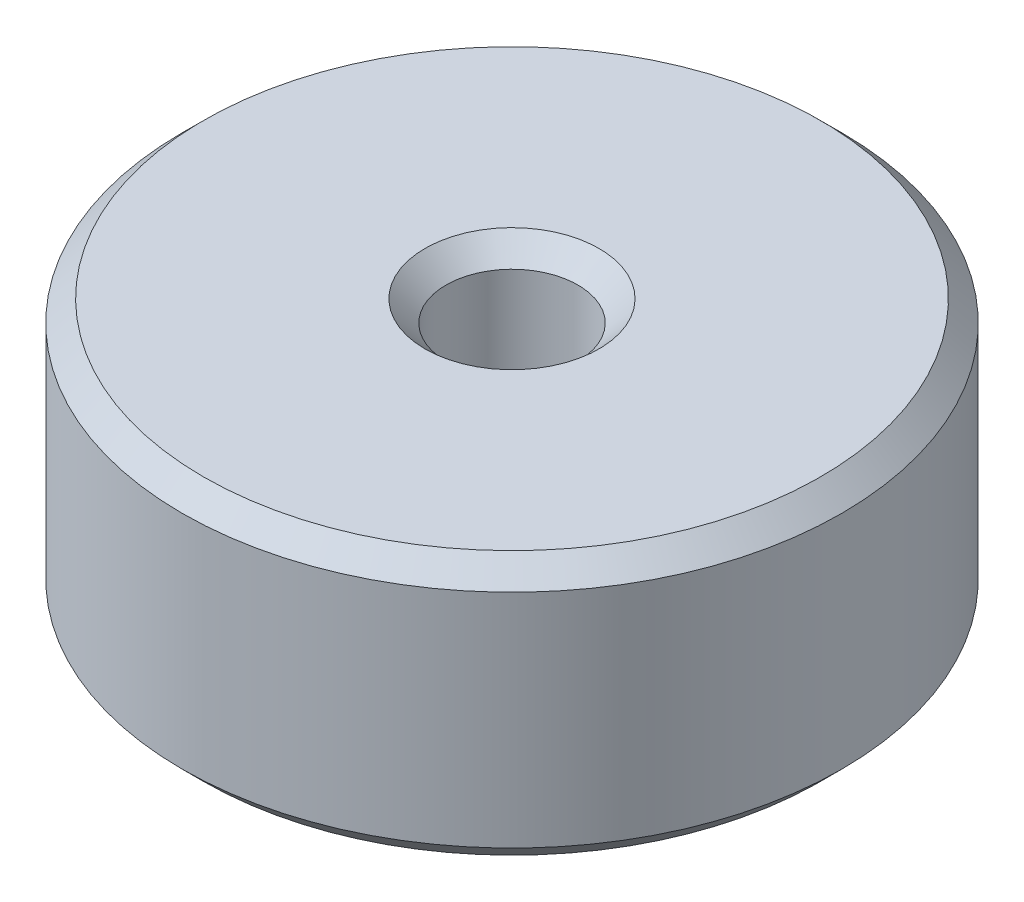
ISO-10303-21;
HEADER;
FILE_DESCRIPTION(('STEP AP214'),'2;1');
FILE_NAME('part.step','',(''),(''),'','','');
FILE_SCHEMA(('AUTOMOTIVE_DESIGN { 1 0 10303 214 1 1 1 1 }'));
ENDSEC;
DATA;
#1=APPLICATION_CONTEXT('core data for automotive mechanical design processes');
#2=APPLICATION_PROTOCOL_DEFINITION('international standard','automotive_design',2000,#1);
#3=PRODUCT_CONTEXT('',#1,'mechanical');
#4=PRODUCT('Part','Part','',(#3));
#5=PRODUCT_RELATED_PRODUCT_CATEGORY('part','',(#4));
#6=PRODUCT_DEFINITION_FORMATION('','',#4);
#7=PRODUCT_DEFINITION_CONTEXT('part definition',#1,'design');
#8=PRODUCT_DEFINITION('design','',#6,#7);
#9=PRODUCT_DEFINITION_SHAPE('','',#8);
#10=(LENGTH_UNIT() NAMED_UNIT(*) SI_UNIT(.MILLI.,.METRE.));
#11=(NAMED_UNIT(*) PLANE_ANGLE_UNIT() SI_UNIT($,.RADIAN.));
#12=(NAMED_UNIT(*) SI_UNIT($,.STERADIAN.) SOLID_ANGLE_UNIT());
#13=UNCERTAINTY_MEASURE_WITH_UNIT(LENGTH_MEASURE(1.E-05),#10,'distance_accuracy_value','');
#14=(GEOMETRIC_REPRESENTATION_CONTEXT(3) GLOBAL_UNCERTAINTY_ASSIGNED_CONTEXT((#13)) GLOBAL_UNIT_ASSIGNED_CONTEXT((#10,
#11,#12)) REPRESENTATION_CONTEXT('',''));
#15=CARTESIAN_POINT('',(0.,0.,0.));
#16=DIRECTION('',(0.,0.,1.));
#17=DIRECTION('',(1.,0.,0.));
#18=AXIS2_PLACEMENT_3D('',#15,#16,#17);
#19=CARTESIAN_POINT('',(0.,3.175,0.));
#20=DIRECTION('',(0.,1.,0.));
#21=DIRECTION('',(0.,0.,1.));
#22=AXIS2_PLACEMENT_3D('',#19,#20,#21);
#23=PLANE('',#22);
#24=CARTESIAN_POINT('',(0.,3.175,0.));
#25=DIRECTION('',(0.,1.,0.));
#26=DIRECTION('',(0.,0.,1.));
#27=AXIS2_PLACEMENT_3D('',#24,#25,#26);
#28=CIRCLE('',#27,1.04775);
#29=CARTESIAN_POINT('',(0.,3.175,1.04775));
#30=VERTEX_POINT('',#29);
#31=EDGE_CURVE('E10',#30,#30,#28,.F.);
#32=ORIENTED_EDGE('',*,*,#31,.T.);
#33=EDGE_LOOP('',(#32));
#34=FACE_BOUND('',#33,.T.);
#35=CARTESIAN_POINT('',(0.,3.175,0.));
#36=DIRECTION('',(0.,1.,0.));
#37=DIRECTION('',(0.,0.,1.));
#38=AXIS2_PLACEMENT_3D('',#35,#36,#37);
#39=CIRCLE('',#38,3.71475);
#40=CARTESIAN_POINT('',(0.,3.175,3.71475));
#41=VERTEX_POINT('',#40);
#42=EDGE_CURVE('E51',#41,#41,#39,.T.);
#43=ORIENTED_EDGE('',*,*,#42,.T.);
#44=EDGE_LOOP('',(#43));
#45=FACE_BOUND('',#44,.T.);
#46=ADVANCED_FACE('F42',(#34,#45),#23,.T.);
#47=CARTESIAN_POINT('',(0.,0.,0.));
#48=DIRECTION('',(0.,1.,0.));
#49=DIRECTION('',(0.,0.,1.));
#50=AXIS2_PLACEMENT_3D('',#47,#48,#49);
#51=PLANE('',#50);
#52=CARTESIAN_POINT('',(0.,0.,0.));
#53=DIRECTION('',(0.,1.,0.));
#54=DIRECTION('',(0.,0.,1.));
#55=AXIS2_PLACEMENT_3D('',#52,#53,#54);
#56=CIRCLE('',#55,1.04775);
#57=CARTESIAN_POINT('',(0.,0.,1.04775));
#58=VERTEX_POINT('',#57);
#59=EDGE_CURVE('E77',#58,#58,#56,.T.);
#60=ORIENTED_EDGE('',*,*,#59,.T.);
#61=EDGE_LOOP('',(#60));
#62=FACE_BOUND('',#61,.T.);
#63=CARTESIAN_POINT('',(0.,0.,0.));
#64=DIRECTION('',(0.,1.,0.));
#65=DIRECTION('',(0.,0.,1.));
#66=AXIS2_PLACEMENT_3D('',#63,#64,#65);
#67=CIRCLE('',#66,3.71475);
#68=CARTESIAN_POINT('',(0.,0.,3.71475));
#69=VERTEX_POINT('',#68);
#70=EDGE_CURVE('E81',#69,#69,#67,.F.);
#71=ORIENTED_EDGE('',*,*,#70,.T.);
#72=EDGE_LOOP('',(#71));
#73=FACE_BOUND('',#72,.T.);
#74=ADVANCED_FACE('F87',(#62,#73),#51,.F.);
#75=CARTESIAN_POINT('',(0.,3.175,0.));
#76=DIRECTION('',(0.,-1.,0.));
#77=DIRECTION('',(0.,0.,-1.));
#78=AXIS2_PLACEMENT_3D('',#75,#76,#77);
#79=CYLINDRICAL_SURFACE('',#78,3.96875);
#80=CARTESIAN_POINT('',(0.,0.254000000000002,0.));
#81=DIRECTION('',(0.,1.,0.));
#82=DIRECTION('',(0.,0.,1.));
#83=AXIS2_PLACEMENT_3D('',#80,#81,#82);
#84=CIRCLE('',#83,3.96875);
#85=CARTESIAN_POINT('',(0.,0.254000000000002,3.96875));
#86=VERTEX_POINT('',#85);
#87=EDGE_CURVE('E57',#86,#86,#84,.T.);
#88=ORIENTED_EDGE('',*,*,#87,.T.);
#89=EDGE_LOOP('',(#88));
#90=FACE_BOUND('',#89,.T.);
#91=CARTESIAN_POINT('',(0.,2.921,0.));
#92=DIRECTION('',(0.,1.,0.));
#93=DIRECTION('',(0.,0.,1.));
#94=AXIS2_PLACEMENT_3D('',#91,#92,#93);
#95=CIRCLE('',#94,3.96875);
#96=CARTESIAN_POINT('',(0.,2.921,3.96875));
#97=VERTEX_POINT('',#96);
#98=EDGE_CURVE('E63',#97,#97,#95,.F.);
#99=ORIENTED_EDGE('',*,*,#98,.T.);
#100=EDGE_LOOP('',(#99));
#101=FACE_BOUND('',#100,.T.);
#102=ADVANCED_FACE('F97',(#90,#101),#79,.T.);
#103=CARTESIAN_POINT('',(0.,3.175,0.));
#104=DIRECTION('',(0.,-1.,0.));
#105=DIRECTION('',(0.,0.,-1.));
#106=AXIS2_PLACEMENT_3D('',#103,#104,#105);
#107=CYLINDRICAL_SURFACE('',#106,0.79375);
#108=CARTESIAN_POINT('',(0.,0.254000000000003,0.));
#109=DIRECTION('',(0.,1.,0.));
#110=DIRECTION('',(0.,0.,1.));
#111=AXIS2_PLACEMENT_3D('',#108,#109,#110);
#112=CIRCLE('',#111,0.79375);
#113=CARTESIAN_POINT('',(0.,0.254000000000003,0.79375));
#114=VERTEX_POINT('',#113);
#115=EDGE_CURVE('E69',#114,#114,#112,.F.);
#116=ORIENTED_EDGE('',*,*,#115,.T.);
#117=EDGE_LOOP('',(#116));
#118=FACE_BOUND('',#117,.T.);
#119=CARTESIAN_POINT('',(0.,2.921,0.));
#120=DIRECTION('',(0.,1.,0.));
#121=DIRECTION('',(0.,0.,1.));
#122=AXIS2_PLACEMENT_3D('',#119,#120,#121);
#123=CIRCLE('',#122,0.79375);
#124=CARTESIAN_POINT('',(0.,2.921,0.79375));
#125=VERTEX_POINT('',#124);
#126=EDGE_CURVE('E73',#125,#125,#123,.T.);
#127=ORIENTED_EDGE('',*,*,#126,.T.);
#128=EDGE_LOOP('',(#127));
#129=FACE_BOUND('',#128,.T.);
#130=ADVANCED_FACE('F100',(#118,#129),#107,.F.);
#131=CARTESIAN_POINT('',(0.,0.,0.));
#132=DIRECTION('',(0.,-1.,0.));
#133=DIRECTION('',(0.,0.,-1.));
#134=AXIS2_PLACEMENT_3D('',#131,#132,#133);
#135=CONICAL_SURFACE('',#134,1.04775,0.785398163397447);
#136=ORIENTED_EDGE('',*,*,#115,.F.);
#137=EDGE_LOOP('',(#136));
#138=FACE_BOUND('',#137,.T.);
#139=ORIENTED_EDGE('',*,*,#59,.F.);
#140=EDGE_LOOP('',(#139));
#141=FACE_BOUND('',#140,.T.);
#142=ADVANCED_FACE('F93',(#138,#141),#135,.F.);
#143=CARTESIAN_POINT('',(0.,0.254000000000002,0.));
#144=DIRECTION('',(0.,1.,0.));
#145=DIRECTION('',(0.,0.,1.));
#146=AXIS2_PLACEMENT_3D('',#143,#144,#145);
#147=CONICAL_SURFACE('',#146,3.96875,0.785398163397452);
#148=ORIENTED_EDGE('',*,*,#70,.F.);
#149=EDGE_LOOP('',(#148));
#150=FACE_BOUND('',#149,.T.);
#151=ORIENTED_EDGE('',*,*,#87,.F.);
#152=EDGE_LOOP('',(#151));
#153=FACE_BOUND('',#152,.T.);
#154=ADVANCED_FACE('F89',(#150,#153),#147,.T.);
#155=CARTESIAN_POINT('',(0.,2.921,0.));
#156=DIRECTION('',(0.,1.,0.));
#157=DIRECTION('',(0.,0.,1.));
#158=AXIS2_PLACEMENT_3D('',#155,#156,#157);
#159=CONICAL_SURFACE('',#158,0.79375,0.785398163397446);
#160=ORIENTED_EDGE('',*,*,#31,.F.);
#161=EDGE_LOOP('',(#160));
#162=FACE_BOUND('',#161,.T.);
#163=ORIENTED_EDGE('',*,*,#126,.F.);
#164=EDGE_LOOP('',(#163));
#165=FACE_BOUND('',#164,.T.);
#166=ADVANCED_FACE('F92',(#162,#165),#159,.F.);
#167=CARTESIAN_POINT('',(0.,3.175,0.));
#168=DIRECTION('',(0.,-1.,0.));
#169=DIRECTION('',(0.,0.,-1.));
#170=AXIS2_PLACEMENT_3D('',#167,#168,#169);
#171=CONICAL_SURFACE('',#170,3.71475,0.785398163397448);
#172=ORIENTED_EDGE('',*,*,#98,.F.);
#173=EDGE_LOOP('',(#172));
#174=FACE_BOUND('',#173,.T.);
#175=ORIENTED_EDGE('',*,*,#42,.F.);
#176=EDGE_LOOP('',(#175));
#177=FACE_BOUND('',#176,.T.);
#178=ADVANCED_FACE('F45',(#174,#177),#171,.T.);
#179=CLOSED_SHELL('',(#46,#74,#102,#130,#142,#154,#166,#178));
#180=MANIFOLD_SOLID_BREP('B2',#179);
#181=ADVANCED_BREP_SHAPE_REPRESENTATION('',(#18,#180),#14);
#182=SHAPE_DEFINITION_REPRESENTATION(#9,#181);
ENDSEC;
END-ISO-10303-21;
